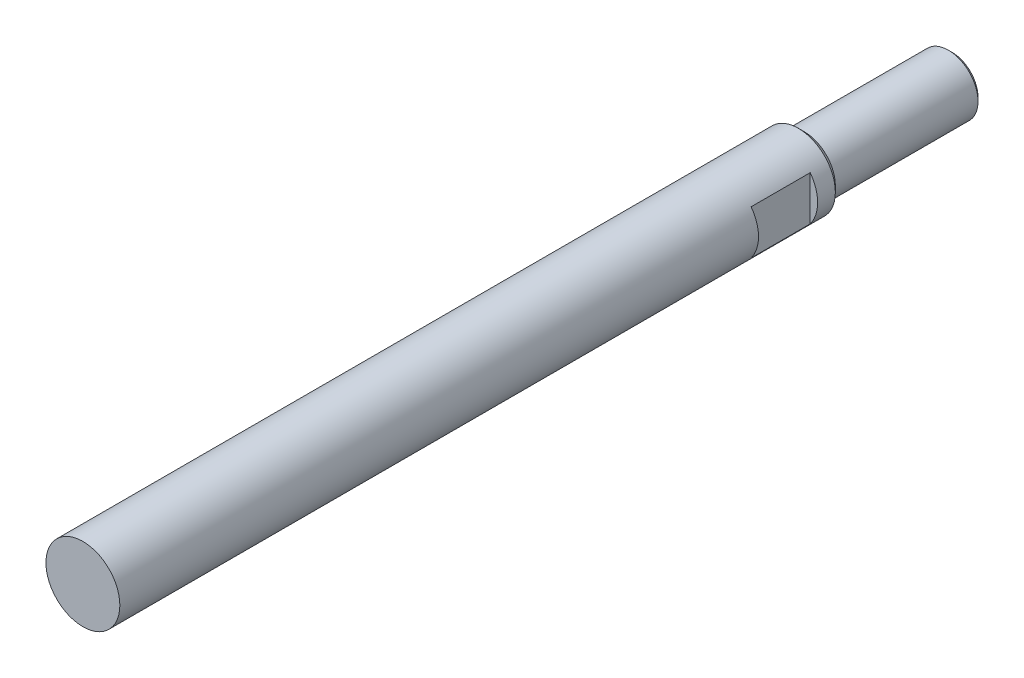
from build123d import *

# Parameters (mm, degrees)
ESQUISSE1_R             = 12.5
EXTRUSION1_DEPTH        = 244
ESQUISSE2_R             = 10
EXTRUSION2_DEPTH        = 50
CHANFREIN1_SIZE         = 1.25
CHANFREIN2_SIZE         = 2
ESQUISSE3_W             = 8.45259497
ESQUISSE3_H             = 20
ESQUISSE3_W_2           = 8.569992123
ENL_V_MAT_EXTRU_1_DEPTH = 15


with BuildPart() as part:
    # Esquisse1 → Extrusion1 (new body)
    with BuildSketch(Plane.XY):
        with Locations(Location((0, 0, 0), (0, 0, 180))):
            Circle(ESQUISSE1_R)
    extrude(amount=EXTRUSION1_DEPTH)

    # Esquisse2 → Extrusion2 (add)
    with BuildSketch(Plane(origin=(0, 0, 0), x_dir=(-1, 0, 0), z_dir=(0, 0, -1))):
        with Locations(Location((0, 0, 0), (0, 0, 180))):
            Circle(ESQUISSE2_R)
    extrude(amount=EXTRUSION2_DEPTH)

    # Chanfrein1
    chanfrein1_edges = [part.edges().sort_by_distance(p)[0] for p in [
        (-10, 0, -50),
    ]]
    chamfer(chanfrein1_edges, length=CHANFREIN1_SIZE)

    # Chanfrein2
    chanfrein2_edges = [part.edges().sort_by_distance(p)[0] for p in [
        (12.5, 0, 0),
    ]]
    chamfer(chanfrein2_edges, length=CHANFREIN2_SIZE)

    # Esquisse3 → Enl_v. mat.-Extru.1 (cut, symmetric)
    with BuildSketch(Plane(origin=(0, 0, 0), x_dir=(1, 0, 0), z_dir=(0, 1, 0))):
        with Locations((14.226297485, -17.992998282)):
            Rectangle(ESQUISSE3_W, ESQUISSE3_H)
        with Locations((-14.284996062, -17.992998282)):
            Rectangle(ESQUISSE3_W_2, ESQUISSE3_H)
    extrude(amount=ENL_V_MAT_EXTRU_1_DEPTH, both=True, mode=Mode.SUBTRACT)


solid = part.part
